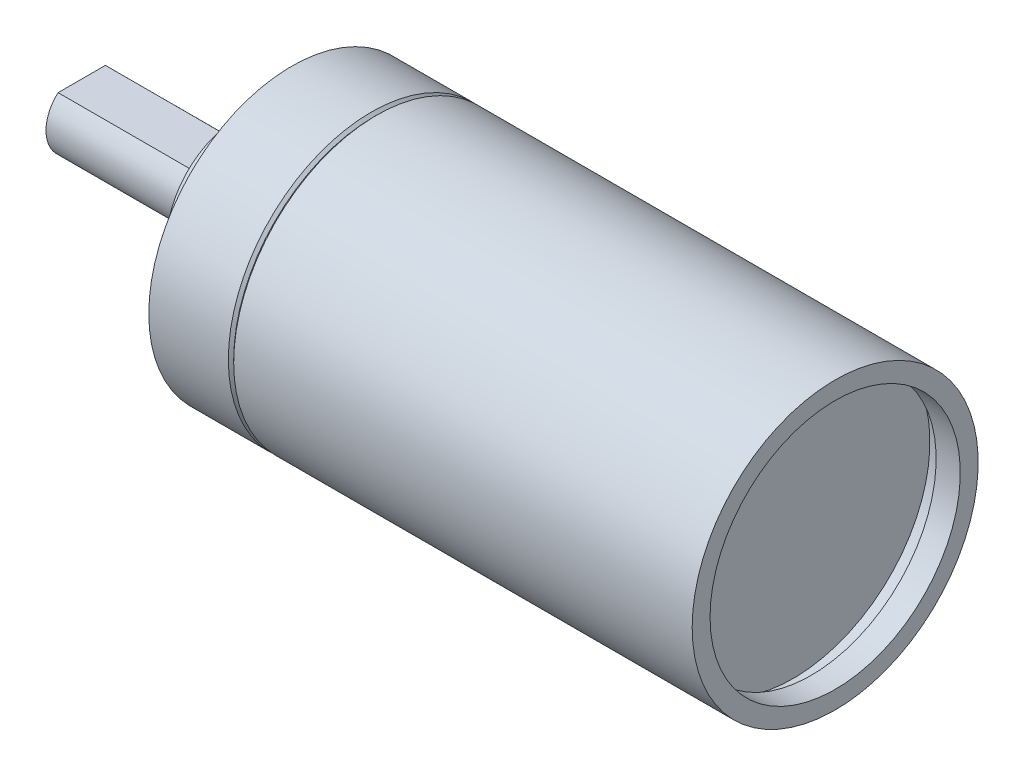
ISO-10303-21;
HEADER;
FILE_DESCRIPTION(('STEP AP214'),'2;1');
FILE_NAME('part.step','',(''),(''),'','','');
FILE_SCHEMA(('AUTOMOTIVE_DESIGN { 1 0 10303 214 1 1 1 1 }'));
ENDSEC;
DATA;
#1=APPLICATION_CONTEXT('core data for automotive mechanical design processes');
#2=APPLICATION_PROTOCOL_DEFINITION('international standard','automotive_design',2000,#1);
#3=PRODUCT_CONTEXT('',#1,'mechanical');
#4=PRODUCT('Part','Part','',(#3));
#5=PRODUCT_RELATED_PRODUCT_CATEGORY('part','',(#4));
#6=PRODUCT_DEFINITION_FORMATION('','',#4);
#7=PRODUCT_DEFINITION_CONTEXT('part definition',#1,'design');
#8=PRODUCT_DEFINITION('design','',#6,#7);
#9=PRODUCT_DEFINITION_SHAPE('','',#8);
#10=(LENGTH_UNIT() NAMED_UNIT(*) SI_UNIT(.MILLI.,.METRE.));
#11=(NAMED_UNIT(*) PLANE_ANGLE_UNIT() SI_UNIT($,.RADIAN.));
#12=(NAMED_UNIT(*) SI_UNIT($,.STERADIAN.) SOLID_ANGLE_UNIT());
#13=UNCERTAINTY_MEASURE_WITH_UNIT(LENGTH_MEASURE(1.E-05),#10,'distance_accuracy_value','');
#14=(GEOMETRIC_REPRESENTATION_CONTEXT(3) GLOBAL_UNCERTAINTY_ASSIGNED_CONTEXT((#13)) GLOBAL_UNIT_ASSIGNED_CONTEXT((#10,
#11,#12)) REPRESENTATION_CONTEXT('',''));
#15=CARTESIAN_POINT('',(0.,0.,0.));
#16=DIRECTION('',(0.,0.,1.));
#17=DIRECTION('',(1.,0.,0.));
#18=AXIS2_PLACEMENT_3D('',#15,#16,#17);
#19=CARTESIAN_POINT('',(-30.05,1.5,-5.));
#20=DIRECTION('',(0.707106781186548,-0.707106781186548,0.));
#21=DIRECTION('',(0.707106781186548,0.707106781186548,0.));
#22=AXIS2_PLACEMENT_3D('',#19,#20,#21);
#23=PLANE('',#22);
#24=CARTESIAN_POINT('',(-31.55,0.,0.));
#25=DIRECTION('',(0.707106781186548,-0.707106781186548,0.));
#26=DIRECTION('',(-0.707106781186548,-0.707106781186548,0.));
#27=AXIS2_PLACEMENT_3D('',#24,#25,#26);
#28=ELLIPSE('',#27,2.82842712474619,2.);
#29=CARTESIAN_POINT('',(-30.0499999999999,1.50000000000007,-1.32287565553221));
#30=VERTEX_POINT('',#29);
#31=CARTESIAN_POINT('',(-30.0499999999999,1.50000000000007,1.32287565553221));
#32=VERTEX_POINT('',#31);
#33=EDGE_CURVE('E19',#30,#32,#28,.T.);
#34=ORIENTED_EDGE('',*,*,#33,.F.);
#35=DIRECTION('',(0.,0.,-1.));
#36=VECTOR('',#35,1.);
#37=CARTESIAN_POINT('',(-30.05,1.5,-5.));
#38=LINE('',#37,#36);
#39=EDGE_CURVE('E60',#30,#32,#38,.F.);
#40=ORIENTED_EDGE('',*,*,#39,.T.);
#41=EDGE_LOOP('',(#34,#40));
#42=FACE_BOUND('',#41,.T.);
#43=ADVANCED_FACE('F16',(#42),#23,.F.);
#44=CARTESIAN_POINT('',(-38.05,0.,0.));
#45=DIRECTION('',(-1.,0.,0.));
#46=DIRECTION('',(0.,0.,1.));
#47=AXIS2_PLACEMENT_3D('',#44,#45,#46);
#48=PLANE('',#47);
#49=CARTESIAN_POINT('',(-38.05,0.,0.));
#50=DIRECTION('',(-1.,0.,0.));
#51=DIRECTION('',(0.,0.,1.));
#52=AXIS2_PLACEMENT_3D('',#49,#50,#51);
#53=CIRCLE('',#52,2.);
#54=CARTESIAN_POINT('',(-38.05,1.50000000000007,1.32287565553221));
#55=VERTEX_POINT('',#54);
#56=CARTESIAN_POINT('',(-38.05,1.50000000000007,-1.32287565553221));
#57=VERTEX_POINT('',#56);
#58=EDGE_CURVE('E72',#55,#57,#53,.F.);
#59=ORIENTED_EDGE('',*,*,#58,.F.);
#60=DIRECTION('',(0.,0.,-1.));
#61=VECTOR('',#60,1.);
#62=CARTESIAN_POINT('',(-38.05,1.5,-5.));
#63=LINE('',#62,#61);
#64=EDGE_CURVE('E69',#55,#57,#63,.T.);
#65=ORIENTED_EDGE('',*,*,#64,.T.);
#66=EDGE_LOOP('',(#59,#65));
#67=FACE_BOUND('',#66,.T.);
#68=ADVANCED_FACE('F469',(#67),#48,.T.);
#69=CARTESIAN_POINT('',(-38.05,1.5,-5.));
#70=DIRECTION('',(0.,-1.,0.));
#71=DIRECTION('',(0.,0.,-1.));
#72=AXIS2_PLACEMENT_3D('',#69,#70,#71);
#73=PLANE('',#72);
#74=DIRECTION('',(-1.,0.,0.));
#75=VECTOR('',#74,1.);
#76=CARTESIAN_POINT('',(1.9025,1.50000000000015,1.32287565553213));
#77=LINE('',#76,#75);
#78=EDGE_CURVE('E68',#32,#55,#77,.T.);
#79=ORIENTED_EDGE('',*,*,#78,.F.);
#80=ORIENTED_EDGE('',*,*,#39,.F.);
#81=DIRECTION('',(-1.,0.,0.));
#82=VECTOR('',#81,1.);
#83=CARTESIAN_POINT('',(1.9025,1.50000000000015,-1.32287565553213));
#84=LINE('',#83,#82);
#85=EDGE_CURVE('E66',#57,#30,#84,.F.);
#86=ORIENTED_EDGE('',*,*,#85,.F.);
#87=ORIENTED_EDGE('',*,*,#64,.F.);
#88=EDGE_LOOP('',(#79,#80,#86,#87));
#89=FACE_BOUND('',#88,.T.);
#90=ADVANCED_FACE('F64',(#89),#73,.F.);
#91=CARTESIAN_POINT('',(1.9025,0.,0.));
#92=DIRECTION('',(-1.,0.,0.));
#93=DIRECTION('',(0.,0.,1.));
#94=AXIS2_PLACEMENT_3D('',#91,#92,#93);
#95=CYLINDRICAL_SURFACE('',#94,2.);
#96=CARTESIAN_POINT('',(-29.3,0.,0.));
#97=DIRECTION('',(-1.,0.,0.));
#98=DIRECTION('',(0.,0.,1.));
#99=AXIS2_PLACEMENT_3D('',#96,#97,#98);
#100=CIRCLE('',#99,2.);
#101=CARTESIAN_POINT('',(-29.3,0.,2.));
#102=VERTEX_POINT('',#101);
#103=EDGE_CURVE('E73',#102,#102,#100,.F.);
#104=ORIENTED_EDGE('',*,*,#103,.F.);
#105=EDGE_LOOP('',(#104));
#106=FACE_BOUND('',#105,.T.);
#107=ORIENTED_EDGE('',*,*,#58,.T.);
#108=ORIENTED_EDGE('',*,*,#85,.T.);
#109=ORIENTED_EDGE('',*,*,#33,.T.);
#110=ORIENTED_EDGE('',*,*,#78,.T.);
#111=EDGE_LOOP('',(#107,#108,#109,#110));
#112=FACE_BOUND('',#111,.T.);
#113=ADVANCED_FACE('F71',(#106,#112),#95,.T.);
#114=CARTESIAN_POINT('',(-29.3,0.,0.));
#115=DIRECTION('',(-1.,0.,0.));
#116=DIRECTION('',(0.,0.,1.));
#117=AXIS2_PLACEMENT_3D('',#114,#115,#116);
#118=PLANE('',#117);
#119=ORIENTED_EDGE('',*,*,#103,.T.);
#120=EDGE_LOOP('',(#119));
#121=FACE_BOUND('',#120,.T.);
#122=CARTESIAN_POINT('',(-29.3,0.,0.));
#123=DIRECTION('',(-1.,0.,0.));
#124=DIRECTION('',(0.,0.,1.));
#125=AXIS2_PLACEMENT_3D('',#122,#123,#124);
#126=CIRCLE('',#125,4.);
#127=CARTESIAN_POINT('',(-29.3,0.,4.));
#128=VERTEX_POINT('',#127);
#129=EDGE_CURVE('E76',#128,#128,#126,.F.);
#130=ORIENTED_EDGE('',*,*,#129,.F.);
#131=EDGE_LOOP('',(#130));
#132=FACE_BOUND('',#131,.T.);
#133=ADVANCED_FACE('F137',(#121,#132),#118,.T.);
#134=CARTESIAN_POINT('',(1.9025,0.,0.));
#135=DIRECTION('',(-1.,0.,0.));
#136=DIRECTION('',(0.,0.,1.));
#137=AXIS2_PLACEMENT_3D('',#134,#135,#136);
#138=CYLINDRICAL_SURFACE('',#137,4.);
#139=ORIENTED_EDGE('',*,*,#129,.T.);
#140=EDGE_LOOP('',(#139));
#141=FACE_BOUND('',#140,.T.);
#142=CARTESIAN_POINT('',(-27.45,0.,0.));
#143=DIRECTION('',(-1.,0.,0.));
#144=DIRECTION('',(0.,0.,1.));
#145=AXIS2_PLACEMENT_3D('',#142,#143,#144);
#146=CIRCLE('',#145,4.);
#147=CARTESIAN_POINT('',(-27.45,0.,4.));
#148=VERTEX_POINT('',#147);
#149=EDGE_CURVE('E128',#148,#148,#146,.F.);
#150=ORIENTED_EDGE('',*,*,#149,.F.);
#151=EDGE_LOOP('',(#150));
#152=FACE_BOUND('',#151,.T.);
#153=ADVANCED_FACE('F134',(#141,#152),#138,.T.);
#154=CARTESIAN_POINT('',(-27.45,0.,0.));
#155=DIRECTION('',(-1.,0.,0.));
#156=DIRECTION('',(0.,0.,1.));
#157=AXIS2_PLACEMENT_3D('',#154,#155,#156);
#158=PLANE('',#157);
#159=ORIENTED_EDGE('',*,*,#149,.T.);
#160=EDGE_LOOP('',(#159));
#161=FACE_BOUND('',#160,.T.);
#162=CARTESIAN_POINT('',(-27.45,0.,0.));
#163=DIRECTION('',(-1.,0.,0.));
#164=DIRECTION('',(0.,0.,1.));
#165=AXIS2_PLACEMENT_3D('',#162,#163,#164);
#166=CIRCLE('',#165,5.);
#167=CARTESIAN_POINT('',(-27.45,0.,5.));
#168=VERTEX_POINT('',#167);
#169=EDGE_CURVE('E125',#168,#168,#166,.F.);
#170=ORIENTED_EDGE('',*,*,#169,.F.);
#171=EDGE_LOOP('',(#170));
#172=FACE_BOUND('',#171,.T.);
#173=ADVANCED_FACE('F146',(#161,#172),#158,.T.);
#174=CARTESIAN_POINT('',(-22.4227487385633,6.5,0.));
#175=DIRECTION('',(-1.,0.,0.));
#176=DIRECTION('',(0.,0.,1.));
#177=AXIS2_PLACEMENT_3D('',#174,#175,#176);
#178=CONICAL_SURFACE('',#177,0.869999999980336,1.02974425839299);
#179=CARTESIAN_POINT('',(-22.42274873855,6.5,0.));
#180=DIRECTION('',(1.,0.,0.));
#181=DIRECTION('',(0.,0.,-1.));
#182=AXIS2_PLACEMENT_3D('',#179,#180,#181);
#183=CIRCLE('',#182,0.87);
#184=CARTESIAN_POINT('',(-22.42274873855,6.5,-0.87));
#185=VERTEX_POINT('',#184);
#186=EDGE_CURVE('E80',#185,#185,#183,.F.);
#187=ORIENTED_EDGE('',*,*,#186,.T.);
#188=EDGE_LOOP('',(#187));
#189=FACE_BOUND('',#188,.T.);
#190=CARTESIAN_POINT('',(-21.8999999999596,6.49999999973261,0.));
#191=VERTEX_POINT('',#190);
#192=VERTEX_LOOP('',#191);
#193=FACE_BOUND('',#192,.T.);
#194=ADVANCED_FACE('F241',(#189,#193),#178,.F.);
#195=CARTESIAN_POINT('',(-22.4227487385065,3.25,5.629165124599));
#196=DIRECTION('',(-1.,0.,0.));
#197=DIRECTION('',(0.,0.,1.));
#198=AXIS2_PLACEMENT_3D('',#195,#196,#197);
#199=CONICAL_SURFACE('',#198,0.869999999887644,1.02974425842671);
#200=CARTESIAN_POINT('',(-22.42274873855,3.25,5.629165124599));
#201=DIRECTION('',(1.,0.,0.));
#202=DIRECTION('',(0.,0.,-1.));
#203=AXIS2_PLACEMENT_3D('',#200,#201,#202);
#204=CIRCLE('',#203,0.87);
#205=CARTESIAN_POINT('',(-22.42274873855,3.25,4.759165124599));
#206=VERTEX_POINT('',#205);
#207=EDGE_CURVE('E274',#206,#206,#204,.F.);
#208=ORIENTED_EDGE('',*,*,#207,.T.);
#209=EDGE_LOOP('',(#208));
#210=FACE_BOUND('',#209,.T.);
#211=CARTESIAN_POINT('',(-21.8999999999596,3.25000000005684,5.62916512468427));
#212=VERTEX_POINT('',#211);
#213=VERTEX_LOOP('',#212);
#214=FACE_BOUND('',#213,.T.);
#215=ADVANCED_FACE('F237',(#210,#214),#199,.F.);
#216=CARTESIAN_POINT('',(-22.4227487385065,-3.25,5.629165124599));
#217=DIRECTION('',(-1.,0.,0.));
#218=DIRECTION('',(0.,0.,1.));
#219=AXIS2_PLACEMENT_3D('',#216,#217,#218);
#220=CONICAL_SURFACE('',#219,0.869999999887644,1.02974425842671);
#221=CARTESIAN_POINT('',(-22.42274873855,-3.25,5.629165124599));
#222=DIRECTION('',(1.,0.,0.));
#223=DIRECTION('',(0.,0.,-1.));
#224=AXIS2_PLACEMENT_3D('',#221,#222,#223);
#225=CIRCLE('',#224,0.87);
#226=CARTESIAN_POINT('',(-22.42274873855,-3.25,4.759165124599));
#227=VERTEX_POINT('',#226);
#228=EDGE_CURVE('E272',#227,#227,#225,.F.);
#229=ORIENTED_EDGE('',*,*,#228,.T.);
#230=EDGE_LOOP('',(#229));
#231=FACE_BOUND('',#230,.T.);
#232=CARTESIAN_POINT('',(-21.8999999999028,-3.25,5.629165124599));
#233=VERTEX_POINT('',#232);
#234=VERTEX_LOOP('',#233);
#235=FACE_BOUND('',#234,.T.);
#236=ADVANCED_FACE('F233',(#231,#235),#220,.F.);
#237=CARTESIAN_POINT('',(-22.4227487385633,-6.5,0.));
#238=DIRECTION('',(-1.,0.,0.));
#239=DIRECTION('',(0.,0.,1.));
#240=AXIS2_PLACEMENT_3D('',#237,#238,#239);
#241=CONICAL_SURFACE('',#240,0.869999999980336,1.02974425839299);
#242=CARTESIAN_POINT('',(-22.42274873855,-6.5,0.));
#243=DIRECTION('',(1.,0.,0.));
#244=DIRECTION('',(0.,0.,-1.));
#245=AXIS2_PLACEMENT_3D('',#242,#243,#244);
#246=CIRCLE('',#245,0.87);
#247=CARTESIAN_POINT('',(-22.42274873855,-6.5,-0.87));
#248=VERTEX_POINT('',#247);
#249=EDGE_CURVE('E269',#248,#248,#246,.F.);
#250=ORIENTED_EDGE('',*,*,#249,.T.);
#251=EDGE_LOOP('',(#250));
#252=FACE_BOUND('',#251,.T.);
#253=CARTESIAN_POINT('',(-21.8999999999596,-6.49999999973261,0.));
#254=VERTEX_POINT('',#253);
#255=VERTEX_LOOP('',#254);
#256=FACE_BOUND('',#255,.T.);
#257=ADVANCED_FACE('F229',(#252,#256),#241,.F.);
#258=CARTESIAN_POINT('',(-22.4227487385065,-3.25,-5.629165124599));
#259=DIRECTION('',(-1.,0.,0.));
#260=DIRECTION('',(0.,0.,1.));
#261=AXIS2_PLACEMENT_3D('',#258,#259,#260);
#262=CONICAL_SURFACE('',#261,0.869999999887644,1.02974425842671);
#263=CARTESIAN_POINT('',(-22.42274873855,-3.25,-5.629165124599));
#264=DIRECTION('',(1.,0.,0.));
#265=DIRECTION('',(0.,0.,-1.));
#266=AXIS2_PLACEMENT_3D('',#263,#264,#265);
#267=CIRCLE('',#266,0.87);
#268=CARTESIAN_POINT('',(-22.42274873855,-3.25,-6.499165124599));
#269=VERTEX_POINT('',#268);
#270=EDGE_CURVE('E266',#269,#269,#267,.F.);
#271=ORIENTED_EDGE('',*,*,#270,.T.);
#272=EDGE_LOOP('',(#271));
#273=FACE_BOUND('',#272,.T.);
#274=CARTESIAN_POINT('',(-21.8999999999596,-3.25000000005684,-5.62916512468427));
#275=VERTEX_POINT('',#274);
#276=VERTEX_LOOP('',#275);
#277=FACE_BOUND('',#276,.T.);
#278=ADVANCED_FACE('F225',(#273,#277),#262,.F.);
#279=CARTESIAN_POINT('',(-22.4227487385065,3.25,-5.629165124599));
#280=DIRECTION('',(-1.,0.,0.));
#281=DIRECTION('',(0.,0.,1.));
#282=AXIS2_PLACEMENT_3D('',#279,#280,#281);
#283=CONICAL_SURFACE('',#282,0.869999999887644,1.02974425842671);
#284=CARTESIAN_POINT('',(-22.42274873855,3.25,-5.629165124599));
#285=DIRECTION('',(1.,0.,0.));
#286=DIRECTION('',(0.,0.,-1.));
#287=AXIS2_PLACEMENT_3D('',#284,#285,#286);
#288=CIRCLE('',#287,0.87);
#289=CARTESIAN_POINT('',(-22.42274873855,3.25,-6.499165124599));
#290=VERTEX_POINT('',#289);
#291=EDGE_CURVE('E124',#290,#290,#288,.F.);
#292=ORIENTED_EDGE('',*,*,#291,.T.);
#293=EDGE_LOOP('',(#292));
#294=FACE_BOUND('',#293,.T.);
#295=CARTESIAN_POINT('',(-21.8999999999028,3.25,-5.629165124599));
#296=VERTEX_POINT('',#295);
#297=VERTEX_LOOP('',#296);
#298=FACE_BOUND('',#297,.T.);
#299=ADVANCED_FACE('F221',(#294,#298),#283,.F.);
#300=CARTESIAN_POINT('',(1.75,0.,0.));
#301=DIRECTION('',(-1.,0.,0.));
#302=DIRECTION('',(0.,0.,1.));
#303=AXIS2_PLACEMENT_3D('',#300,#301,#302);
#304=PLANE('',#303);
#305=CARTESIAN_POINT('',(1.75,0.,0.));
#306=DIRECTION('',(-1.,0.,0.));
#307=DIRECTION('',(0.,0.,1.));
#308=AXIS2_PLACEMENT_3D('',#305,#306,#307);
#309=CIRCLE('',#308,7.65);
#310=CARTESIAN_POINT('',(1.75,0.,7.65));
#311=VERTEX_POINT('',#310);
#312=EDGE_CURVE('E121',#311,#311,#309,.F.);
#313=ORIENTED_EDGE('',*,*,#312,.T.);
#314=EDGE_LOOP('',(#313));
#315=FACE_BOUND('',#314,.T.);
#316=ADVANCED_FACE('F217',(#315),#304,.F.);
#317=CARTESIAN_POINT('',(1.9025,0.,0.));
#318=DIRECTION('',(-1.,0.,0.));
#319=DIRECTION('',(0.,0.,1.));
#320=AXIS2_PLACEMENT_3D('',#317,#318,#319);
#321=CYLINDRICAL_SURFACE('',#320,5.);
#322=ORIENTED_EDGE('',*,*,#169,.T.);
#323=EDGE_LOOP('',(#322));
#324=FACE_BOUND('',#323,.T.);
#325=CARTESIAN_POINT('',(-26.3,0.,0.));
#326=DIRECTION('',(-1.,0.,0.));
#327=DIRECTION('',(0.,0.,1.));
#328=AXIS2_PLACEMENT_3D('',#325,#326,#327);
#329=CIRCLE('',#328,5.);
#330=CARTESIAN_POINT('',(-26.3,0.,5.));
#331=VERTEX_POINT('',#330);
#332=EDGE_CURVE('E118',#331,#331,#329,.F.);
#333=ORIENTED_EDGE('',*,*,#332,.F.);
#334=EDGE_LOOP('',(#333));
#335=FACE_BOUND('',#334,.T.);
#336=ADVANCED_FACE('F213',(#324,#335),#321,.T.);
#337=CARTESIAN_POINT('',(-26.52,6.5,0.));
#338=DIRECTION('',(1.,0.,0.));
#339=DIRECTION('',(0.,0.,-1.));
#340=AXIS2_PLACEMENT_3D('',#337,#338,#339);
#341=CYLINDRICAL_SURFACE('',#340,0.87);
#342=ORIENTED_EDGE('',*,*,#186,.F.);
#343=EDGE_LOOP('',(#342));
#344=FACE_BOUND('',#343,.T.);
#345=CARTESIAN_POINT('',(-26.3,6.5,0.));
#346=DIRECTION('',(1.,0.,0.));
#347=DIRECTION('',(0.,0.,-1.));
#348=AXIS2_PLACEMENT_3D('',#345,#346,#347);
#349=CIRCLE('',#348,0.87);
#350=CARTESIAN_POINT('',(-26.3,6.5,-0.87));
#351=VERTEX_POINT('',#350);
#352=EDGE_CURVE('E115',#351,#351,#349,.T.);
#353=ORIENTED_EDGE('',*,*,#352,.F.);
#354=EDGE_LOOP('',(#353));
#355=FACE_BOUND('',#354,.T.);
#356=ADVANCED_FACE('F209',(#344,#355),#341,.F.);
#357=CARTESIAN_POINT('',(-26.52,3.25,5.629165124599));
#358=DIRECTION('',(1.,0.,0.));
#359=DIRECTION('',(0.,0.,-1.));
#360=AXIS2_PLACEMENT_3D('',#357,#358,#359);
#361=CYLINDRICAL_SURFACE('',#360,0.87);
#362=CARTESIAN_POINT('',(-26.3,3.25,5.629165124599));
#363=DIRECTION('',(1.,0.,0.));
#364=DIRECTION('',(0.,0.,-1.));
#365=AXIS2_PLACEMENT_3D('',#362,#363,#364);
#366=CIRCLE('',#365,0.87);
#367=CARTESIAN_POINT('',(-26.3,3.25,4.759165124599));
#368=VERTEX_POINT('',#367);
#369=EDGE_CURVE('E112',#368,#368,#366,.T.);
#370=ORIENTED_EDGE('',*,*,#369,.F.);
#371=EDGE_LOOP('',(#370));
#372=FACE_BOUND('',#371,.T.);
#373=ORIENTED_EDGE('',*,*,#207,.F.);
#374=EDGE_LOOP('',(#373));
#375=FACE_BOUND('',#374,.T.);
#376=ADVANCED_FACE('F205',(#372,#375),#361,.F.);
#377=CARTESIAN_POINT('',(-26.52,-3.25,5.629165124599));
#378=DIRECTION('',(1.,0.,0.));
#379=DIRECTION('',(0.,0.,-1.));
#380=AXIS2_PLACEMENT_3D('',#377,#378,#379);
#381=CYLINDRICAL_SURFACE('',#380,0.87);
#382=CARTESIAN_POINT('',(-26.3,-3.25,5.629165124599));
#383=DIRECTION('',(1.,0.,0.));
#384=DIRECTION('',(0.,0.,-1.));
#385=AXIS2_PLACEMENT_3D('',#382,#383,#384);
#386=CIRCLE('',#385,0.87);
#387=CARTESIAN_POINT('',(-26.3,-3.25,4.759165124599));
#388=VERTEX_POINT('',#387);
#389=EDGE_CURVE('E109',#388,#388,#386,.T.);
#390=ORIENTED_EDGE('',*,*,#389,.F.);
#391=EDGE_LOOP('',(#390));
#392=FACE_BOUND('',#391,.T.);
#393=ORIENTED_EDGE('',*,*,#228,.F.);
#394=EDGE_LOOP('',(#393));
#395=FACE_BOUND('',#394,.T.);
#396=ADVANCED_FACE('F201',(#392,#395),#381,.F.);
#397=CARTESIAN_POINT('',(-26.52,-6.5,0.));
#398=DIRECTION('',(1.,0.,0.));
#399=DIRECTION('',(0.,0.,-1.));
#400=AXIS2_PLACEMENT_3D('',#397,#398,#399);
#401=CYLINDRICAL_SURFACE('',#400,0.87);
#402=CARTESIAN_POINT('',(-26.3,-6.5,0.));
#403=DIRECTION('',(1.,0.,0.));
#404=DIRECTION('',(0.,0.,-1.));
#405=AXIS2_PLACEMENT_3D('',#402,#403,#404);
#406=CIRCLE('',#405,0.87);
#407=CARTESIAN_POINT('',(-26.3,-6.5,-0.87));
#408=VERTEX_POINT('',#407);
#409=EDGE_CURVE('E106',#408,#408,#406,.T.);
#410=ORIENTED_EDGE('',*,*,#409,.F.);
#411=EDGE_LOOP('',(#410));
#412=FACE_BOUND('',#411,.T.);
#413=ORIENTED_EDGE('',*,*,#249,.F.);
#414=EDGE_LOOP('',(#413));
#415=FACE_BOUND('',#414,.T.);
#416=ADVANCED_FACE('F197',(#412,#415),#401,.F.);
#417=CARTESIAN_POINT('',(-26.52,-3.25,-5.629165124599));
#418=DIRECTION('',(1.,0.,0.));
#419=DIRECTION('',(0.,0.,-1.));
#420=AXIS2_PLACEMENT_3D('',#417,#418,#419);
#421=CYLINDRICAL_SURFACE('',#420,0.87);
#422=CARTESIAN_POINT('',(-26.3,-3.25,-5.629165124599));
#423=DIRECTION('',(1.,0.,0.));
#424=DIRECTION('',(0.,0.,-1.));
#425=AXIS2_PLACEMENT_3D('',#422,#423,#424);
#426=CIRCLE('',#425,0.87);
#427=CARTESIAN_POINT('',(-26.3,-3.25,-6.499165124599));
#428=VERTEX_POINT('',#427);
#429=EDGE_CURVE('E103',#428,#428,#426,.T.);
#430=ORIENTED_EDGE('',*,*,#429,.F.);
#431=EDGE_LOOP('',(#430));
#432=FACE_BOUND('',#431,.T.);
#433=ORIENTED_EDGE('',*,*,#270,.F.);
#434=EDGE_LOOP('',(#433));
#435=FACE_BOUND('',#434,.T.);
#436=ADVANCED_FACE('F193',(#432,#435),#421,.F.);
#437=CARTESIAN_POINT('',(-26.52,3.25,-5.629165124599));
#438=DIRECTION('',(1.,0.,0.));
#439=DIRECTION('',(0.,0.,-1.));
#440=AXIS2_PLACEMENT_3D('',#437,#438,#439);
#441=CYLINDRICAL_SURFACE('',#440,0.87);
#442=CARTESIAN_POINT('',(-26.3,3.25,-5.629165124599));
#443=DIRECTION('',(1.,0.,0.));
#444=DIRECTION('',(0.,0.,-1.));
#445=AXIS2_PLACEMENT_3D('',#442,#443,#444);
#446=CIRCLE('',#445,0.87);
#447=CARTESIAN_POINT('',(-26.3,3.25,-6.499165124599));
#448=VERTEX_POINT('',#447);
#449=EDGE_CURVE('E100',#448,#448,#446,.T.);
#450=ORIENTED_EDGE('',*,*,#449,.F.);
#451=EDGE_LOOP('',(#450));
#452=FACE_BOUND('',#451,.T.);
#453=ORIENTED_EDGE('',*,*,#291,.F.);
#454=EDGE_LOOP('',(#453));
#455=FACE_BOUND('',#454,.T.);
#456=ADVANCED_FACE('F189',(#452,#455),#441,.F.);
#457=CARTESIAN_POINT('',(6.0025,0.,0.));
#458=DIRECTION('',(-1.,0.,0.));
#459=DIRECTION('',(0.,0.,1.));
#460=AXIS2_PLACEMENT_3D('',#457,#458,#459);
#461=CYLINDRICAL_SURFACE('',#460,7.65);
#462=ORIENTED_EDGE('',*,*,#312,.F.);
#463=EDGE_LOOP('',(#462));
#464=FACE_BOUND('',#463,.T.);
#465=CARTESIAN_POINT('',(2.75,0.,0.));
#466=DIRECTION('',(-1.,0.,0.));
#467=DIRECTION('',(0.,0.,1.));
#468=AXIS2_PLACEMENT_3D('',#465,#466,#467);
#469=CIRCLE('',#468,7.65);
#470=CARTESIAN_POINT('',(2.75,0.,7.65));
#471=VERTEX_POINT('',#470);
#472=EDGE_CURVE('E97',#471,#471,#469,.T.);
#473=ORIENTED_EDGE('',*,*,#472,.F.);
#474=EDGE_LOOP('',(#473));
#475=FACE_BOUND('',#474,.T.);
#476=ADVANCED_FACE('F185',(#464,#475),#461,.F.);
#477=CARTESIAN_POINT('',(-26.3,0.,0.));
#478=DIRECTION('',(-1.,0.,0.));
#479=DIRECTION('',(0.,0.,1.));
#480=AXIS2_PLACEMENT_3D('',#477,#478,#479);
#481=PLANE('',#480);
#482=ORIENTED_EDGE('',*,*,#449,.T.);
#483=EDGE_LOOP('',(#482));
#484=FACE_BOUND('',#483,.T.);
#485=ORIENTED_EDGE('',*,*,#429,.T.);
#486=EDGE_LOOP('',(#485));
#487=FACE_BOUND('',#486,.T.);
#488=ORIENTED_EDGE('',*,*,#409,.T.);
#489=EDGE_LOOP('',(#488));
#490=FACE_BOUND('',#489,.T.);
#491=ORIENTED_EDGE('',*,*,#389,.T.);
#492=EDGE_LOOP('',(#491));
#493=FACE_BOUND('',#492,.T.);
#494=ORIENTED_EDGE('',*,*,#369,.T.);
#495=EDGE_LOOP('',(#494));
#496=FACE_BOUND('',#495,.T.);
#497=ORIENTED_EDGE('',*,*,#352,.T.);
#498=EDGE_LOOP('',(#497));
#499=FACE_BOUND('',#498,.T.);
#500=ORIENTED_EDGE('',*,*,#332,.T.);
#501=EDGE_LOOP('',(#500));
#502=FACE_BOUND('',#501,.T.);
#503=CARTESIAN_POINT('',(-26.3,0.,0.));
#504=DIRECTION('',(-1.,0.,0.));
#505=DIRECTION('',(0.,0.,1.));
#506=AXIS2_PLACEMENT_3D('',#503,#504,#505);
#507=CIRCLE('',#506,8.);
#508=CARTESIAN_POINT('',(-26.3,0.,8.));
#509=VERTEX_POINT('',#508);
#510=EDGE_CURVE('E94',#509,#509,#507,.F.);
#511=ORIENTED_EDGE('',*,*,#510,.F.);
#512=EDGE_LOOP('',(#511));
#513=FACE_BOUND('',#512,.T.);
#514=ADVANCED_FACE('F181',(#484,#487,#490,#493,#496,#499,#502,#513),#481,.T.);
#515=CARTESIAN_POINT('',(2.75,0.,0.));
#516=DIRECTION('',(-1.,0.,0.));
#517=DIRECTION('',(0.,0.,1.));
#518=AXIS2_PLACEMENT_3D('',#515,#516,#517);
#519=PLANE('',#518);
#520=CARTESIAN_POINT('',(2.75,0.,0.));
#521=DIRECTION('',(-1.,0.,0.));
#522=DIRECTION('',(0.,0.,1.));
#523=AXIS2_PLACEMENT_3D('',#520,#521,#522);
#524=CIRCLE('',#523,7.);
#525=CARTESIAN_POINT('',(2.75,0.,7.));
#526=VERTEX_POINT('',#525);
#527=EDGE_CURVE('E91',#526,#526,#524,.F.);
#528=ORIENTED_EDGE('',*,*,#527,.T.);
#529=EDGE_LOOP('',(#528));
#530=FACE_BOUND('',#529,.T.);
#531=ORIENTED_EDGE('',*,*,#472,.T.);
#532=EDGE_LOOP('',(#531));
#533=FACE_BOUND('',#532,.T.);
#534=ADVANCED_FACE('F177',(#530,#533),#519,.T.);
#535=CARTESIAN_POINT('',(1.9025,0.,0.));
#536=DIRECTION('',(-1.,0.,0.));
#537=DIRECTION('',(0.,0.,1.));
#538=AXIS2_PLACEMENT_3D('',#535,#536,#537);
#539=CYLINDRICAL_SURFACE('',#538,8.);
#540=ORIENTED_EDGE('',*,*,#510,.T.);
#541=EDGE_LOOP('',(#540));
#542=FACE_BOUND('',#541,.T.);
#543=CARTESIAN_POINT('',(-21.85,0.,0.));
#544=DIRECTION('',(-1.,0.,0.));
#545=DIRECTION('',(0.,1.,0.));
#546=AXIS2_PLACEMENT_3D('',#543,#544,#545);
#547=CIRCLE('',#546,7.99999999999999);
#548=CARTESIAN_POINT('',(-21.85,7.99999999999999,0.));
#549=VERTEX_POINT('',#548);
#550=EDGE_CURVE('E90',#549,#549,#547,.F.);
#551=ORIENTED_EDGE('',*,*,#550,.F.);
#552=EDGE_LOOP('',(#551));
#553=FACE_BOUND('',#552,.T.);
#554=ADVANCED_FACE('F173',(#542,#553),#539,.T.);
#555=CARTESIAN_POINT('',(6.0025,0.,0.));
#556=DIRECTION('',(-1.,0.,0.));
#557=DIRECTION('',(0.,0.,1.));
#558=AXIS2_PLACEMENT_3D('',#555,#556,#557);
#559=CYLINDRICAL_SURFACE('',#558,7.);
#560=CARTESIAN_POINT('',(4.1,0.,0.));
#561=DIRECTION('',(-1.,0.,0.));
#562=DIRECTION('',(0.,0.,1.));
#563=AXIS2_PLACEMENT_3D('',#560,#561,#562);
#564=CIRCLE('',#563,7.);
#565=CARTESIAN_POINT('',(4.1,0.,7.));
#566=VERTEX_POINT('',#565);
#567=EDGE_CURVE('E87',#566,#566,#564,.F.);
#568=ORIENTED_EDGE('',*,*,#567,.T.);
#569=EDGE_LOOP('',(#568));
#570=FACE_BOUND('',#569,.T.);
#571=ORIENTED_EDGE('',*,*,#527,.F.);
#572=EDGE_LOOP('',(#571));
#573=FACE_BOUND('',#572,.T.);
#574=ADVANCED_FACE('F169',(#570,#573),#559,.F.);
#575=CARTESIAN_POINT('',(-21.85,0.,0.));
#576=DIRECTION('',(-1.,0.,0.));
#577=DIRECTION('',(0.,0.,1.));
#578=AXIS2_PLACEMENT_3D('',#575,#576,#577);
#579=CONICAL_SURFACE('',#578,7.99999999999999,0.785398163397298);
#580=ORIENTED_EDGE('',*,*,#550,.T.);
#581=EDGE_LOOP('',(#580));
#582=FACE_BOUND('',#581,.T.);
#583=CARTESIAN_POINT('',(-21.7,0.,0.));
#584=DIRECTION('',(1.,0.,0.));
#585=DIRECTION('',(0.,-1.,0.));
#586=AXIS2_PLACEMENT_3D('',#583,#584,#585);
#587=CIRCLE('',#586,7.85);
#588=CARTESIAN_POINT('',(-21.7,-7.85,0.));
#589=VERTEX_POINT('',#588);
#590=EDGE_CURVE('E86',#589,#589,#587,.T.);
#591=ORIENTED_EDGE('',*,*,#590,.F.);
#592=EDGE_LOOP('',(#591));
#593=FACE_BOUND('',#592,.T.);
#594=ADVANCED_FACE('F165',(#582,#593),#579,.T.);
#595=CARTESIAN_POINT('',(4.1,0.,0.));
#596=DIRECTION('',(-1.,0.,0.));
#597=DIRECTION('',(0.,0.,1.));
#598=AXIS2_PLACEMENT_3D('',#595,#596,#597);
#599=PLANE('',#598);
#600=ORIENTED_EDGE('',*,*,#567,.F.);
#601=EDGE_LOOP('',(#600));
#602=FACE_BOUND('',#601,.T.);
#603=CARTESIAN_POINT('',(4.1,0.,0.));
#604=DIRECTION('',(-1.,0.,0.));
#605=DIRECTION('',(0.,0.,1.));
#606=AXIS2_PLACEMENT_3D('',#603,#604,#605);
#607=CIRCLE('',#606,8.);
#608=CARTESIAN_POINT('',(4.1,0.,8.));
#609=VERTEX_POINT('',#608);
#610=EDGE_CURVE('E25',#609,#609,#607,.T.);
#611=ORIENTED_EDGE('',*,*,#610,.F.);
#612=EDGE_LOOP('',(#611));
#613=FACE_BOUND('',#612,.T.);
#614=ADVANCED_FACE('F158',(#602,#613),#599,.F.);
#615=CARTESIAN_POINT('',(-21.55,0.,0.));
#616=DIRECTION('',(1.,0.,0.));
#617=DIRECTION('',(0.,0.,-1.));
#618=AXIS2_PLACEMENT_3D('',#615,#616,#617);
#619=CONICAL_SURFACE('',#618,8.,0.785398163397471);
#620=ORIENTED_EDGE('',*,*,#590,.T.);
#621=EDGE_LOOP('',(#620));
#622=FACE_BOUND('',#621,.T.);
#623=CARTESIAN_POINT('',(-21.55,0.,0.));
#624=DIRECTION('',(-1.,0.,0.));
#625=DIRECTION('',(0.,0.,1.));
#626=AXIS2_PLACEMENT_3D('',#623,#624,#625);
#627=CIRCLE('',#626,8.);
#628=CARTESIAN_POINT('',(-21.55,0.,8.));
#629=VERTEX_POINT('',#628);
#630=EDGE_CURVE('E11',#629,#629,#627,.F.);
#631=ORIENTED_EDGE('',*,*,#630,.F.);
#632=EDGE_LOOP('',(#631));
#633=FACE_BOUND('',#632,.T.);
#634=ADVANCED_FACE('F152',(#622,#633),#619,.T.);
#635=CARTESIAN_POINT('',(1.9025,0.,0.));
#636=DIRECTION('',(-1.,0.,0.));
#637=DIRECTION('',(0.,0.,1.));
#638=AXIS2_PLACEMENT_3D('',#635,#636,#637);
#639=CYLINDRICAL_SURFACE('',#638,8.);
#640=ORIENTED_EDGE('',*,*,#630,.T.);
#641=EDGE_LOOP('',(#640));
#642=FACE_BOUND('',#641,.T.);
#643=ORIENTED_EDGE('',*,*,#610,.T.);
#644=EDGE_LOOP('',(#643));
#645=FACE_BOUND('',#644,.T.);
#646=ADVANCED_FACE('F150',(#642,#645),#639,.T.);
#647=CLOSED_SHELL('',(#43,#68,#90,#113,#133,#153,#173,#194,#215,#236,#257,#278,#299,#316,#336,
#356,#376,#396,#416,#436,#456,#476,#514,#534,#554,#574,#594,#614,#634,#646));
#648=MANIFOLD_SOLID_BREP('B1',#647);
#649=ADVANCED_BREP_SHAPE_REPRESENTATION('',(#18,#648),#14);
#650=SHAPE_DEFINITION_REPRESENTATION(#9,#649);
ENDSEC;
END-ISO-10303-21;
